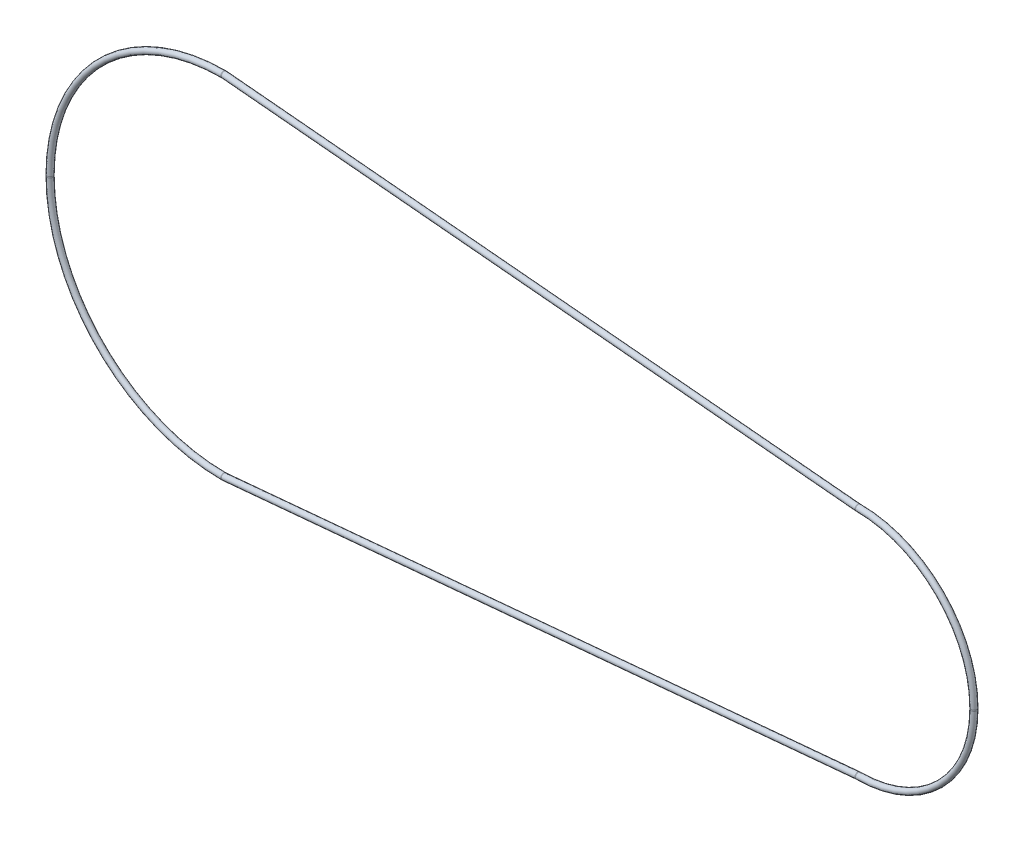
ISO-10303-21;
HEADER;
FILE_DESCRIPTION(('STEP AP214'),'2;1');
FILE_NAME('part.step','',(''),(''),'','','');
FILE_SCHEMA(('AUTOMOTIVE_DESIGN { 1 0 10303 214 1 1 1 1 }'));
ENDSEC;
DATA;
#1=APPLICATION_CONTEXT('core data for automotive mechanical design processes');
#2=APPLICATION_PROTOCOL_DEFINITION('international standard','automotive_design',2000,#1);
#3=PRODUCT_CONTEXT('',#1,'mechanical');
#4=PRODUCT('Part','Part','',(#3));
#5=PRODUCT_RELATED_PRODUCT_CATEGORY('part','',(#4));
#6=PRODUCT_DEFINITION_FORMATION('','',#4);
#7=PRODUCT_DEFINITION_CONTEXT('part definition',#1,'design');
#8=PRODUCT_DEFINITION('design','',#6,#7);
#9=PRODUCT_DEFINITION_SHAPE('','',#8);
#10=(LENGTH_UNIT() NAMED_UNIT(*) SI_UNIT(.MILLI.,.METRE.));
#11=(NAMED_UNIT(*) PLANE_ANGLE_UNIT() SI_UNIT($,.RADIAN.));
#12=(NAMED_UNIT(*) SI_UNIT($,.STERADIAN.) SOLID_ANGLE_UNIT());
#13=UNCERTAINTY_MEASURE_WITH_UNIT(LENGTH_MEASURE(1.E-05),#10,'distance_accuracy_value','');
#14=(GEOMETRIC_REPRESENTATION_CONTEXT(3) GLOBAL_UNCERTAINTY_ASSIGNED_CONTEXT((#13)) GLOBAL_UNIT_ASSIGNED_CONTEXT((#10,
#11,#12)) REPRESENTATION_CONTEXT('',''));
#15=CARTESIAN_POINT('',(0.,0.,0.));
#16=DIRECTION('',(0.,0.,1.));
#17=DIRECTION('',(1.,0.,0.));
#18=AXIS2_PLACEMENT_3D('',#15,#16,#17);
#19=CARTESIAN_POINT('',(-52.0949708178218,31.5005265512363,9.00000000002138));
#20=DIRECTION('',(1.,0.,0.));
#21=DIRECTION('',(0.,0.,-1.));
#22=AXIS2_PLACEMENT_3D('',#19,#20,#21);
#23=CYLINDRICAL_SURFACE('',#22,0.500000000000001);
#24=CARTESIAN_POINT('',(-52.0949708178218,31.5005265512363,9.00000000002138));
#25=DIRECTION('',(1.,0.,0.));
#26=DIRECTION('',(0.,1.,0.));
#27=AXIS2_PLACEMENT_3D('',#24,#25,#26);
#28=CIRCLE('',#27,0.500000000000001);
#29=CARTESIAN_POINT('',(-52.0949708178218,32.0005265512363,9.00000000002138));
#30=VERTEX_POINT('',#29);
#31=EDGE_CURVE('E44',#30,#30,#28,.T.);
#32=ORIENTED_EDGE('',*,*,#31,.T.);
#33=EDGE_LOOP('',(#32));
#34=FACE_BOUND('',#33,.T.);
#35=CARTESIAN_POINT('',(-51.972121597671,32.0005265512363,9.00000000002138));
#36=CARTESIAN_POINT('',(-51.9721216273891,32.0005266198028,8.99353181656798));
#37=CARTESIAN_POINT('',(-51.9721274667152,32.0004010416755,8.98706363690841));
#38=CARTESIAN_POINT('',(-51.9721507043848,31.999898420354,8.9741199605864));
#39=CARTESIAN_POINT('',(-51.9721681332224,31.9995207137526,8.96764448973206));
#40=CARTESIAN_POINT('',(-51.9722145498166,31.9985123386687,8.95469612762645));
#41=CARTESIAN_POINT('',(-51.9722435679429,31.9978810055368,8.94822328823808));
#42=CARTESIAN_POINT('',(-51.972313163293,31.9963643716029,8.93529020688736));
#43=CARTESIAN_POINT('',(-51.9723537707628,31.9954784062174,8.92883004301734));
#44=CARTESIAN_POINT('',(-51.9724465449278,31.9934518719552,8.91593244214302));
#45=CARTESIAN_POINT('',(-51.9724987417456,31.9923106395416,8.90949510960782));
#46=CARTESIAN_POINT('',(-51.9726146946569,31.9897733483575,8.89665339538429));
#47=CARTESIAN_POINT('',(-51.9726784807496,31.9883766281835,8.8902491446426));
#48=CARTESIAN_POINT('',(-51.9728176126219,31.9853285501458,8.87748389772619));
#49=CARTESIAN_POINT('',(-51.9728929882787,31.9836765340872,8.87112305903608));
#50=CARTESIAN_POINT('',(-51.9730552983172,31.9801184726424,8.85845500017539));
#51=CARTESIAN_POINT('',(-51.9731422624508,31.9782117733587,8.85214796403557));
#52=CARTESIAN_POINT('',(-51.9733277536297,31.9741453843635,8.8395979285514));
#53=CARTESIAN_POINT('',(-51.9734263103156,31.9719850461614,8.83335513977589));
#54=CARTESIAN_POINT('',(-51.9736349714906,31.9674128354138,8.82094401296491));
#55=CARTESIAN_POINT('',(-51.9737451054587,31.9650003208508,8.8147759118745));
#56=CARTESIAN_POINT('',(-51.9739707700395,31.9600615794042,8.80285272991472));
#57=CARTESIAN_POINT('',(-51.9740857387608,31.9575474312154,8.79709263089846));
#58=CARTESIAN_POINT('',(-51.9743267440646,31.9522795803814,8.78561851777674));
#59=CARTESIAN_POINT('',(-51.9744528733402,31.9495238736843,8.77990542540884));
#60=CARTESIAN_POINT('',(-51.9747161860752,31.9437709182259,8.76853641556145));
#61=CARTESIAN_POINT('',(-51.9748534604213,31.9407716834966,8.76288150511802));
#62=CARTESIAN_POINT('',(-51.9751390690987,31.934530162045,8.75164023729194));
#63=CARTESIAN_POINT('',(-51.9752874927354,31.9312859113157,8.74605497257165));
#64=CARTESIAN_POINT('',(-51.9755954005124,31.9245533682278,8.73496468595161));
#65=CARTESIAN_POINT('',(-51.9757549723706,31.9210631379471,8.72946084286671));
#66=CARTESIAN_POINT('',(-51.9760851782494,31.9138381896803,8.71854537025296));
#67=CARTESIAN_POINT('',(-51.976255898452,31.9101015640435,8.71313500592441));
#68=CARTESIAN_POINT('',(-51.9766084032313,31.9023839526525,8.70241872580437));
#69=CARTESIAN_POINT('',(-51.9767902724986,31.8984010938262,8.69711416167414));
#70=CARTESIAN_POINT('',(-51.9771650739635,31.8901917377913,8.68662195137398));
#71=CARTESIAN_POINT('',(-51.9773580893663,31.885963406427,8.68143574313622));
#72=CARTESIAN_POINT('',(-51.9777551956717,31.8772644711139,8.67119294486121));
#73=CARTESIAN_POINT('',(-51.9779593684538,31.8727920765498,8.66613787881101));
#74=CARTESIAN_POINT('',(-51.9783787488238,31.8636069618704,8.65617018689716));
#75=CARTESIAN_POINT('',(-51.9785940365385,31.8588924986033,8.65125916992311));
#76=CARTESIAN_POINT('',(-51.979006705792,31.8498629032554,8.64222956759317));
#77=CARTESIAN_POINT('',(-51.9792030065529,31.8455705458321,8.6380881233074));
#78=CARTESIAN_POINT('',(-51.9796067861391,31.8367458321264,8.62987337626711));
#79=CARTESIAN_POINT('',(-51.9798144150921,31.832210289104,8.62580350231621));
#80=CARTESIAN_POINT('',(-51.9802408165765,31.8228957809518,8.61774773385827));
#81=CARTESIAN_POINT('',(-51.9804597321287,31.8181136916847,8.61376545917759));
#82=CARTESIAN_POINT('',(-51.9809087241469,31.8083034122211,8.60590135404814));
#83=CARTESIAN_POINT('',(-51.9811389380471,31.8032721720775,8.60202333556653));
#84=CARTESIAN_POINT('',(-51.9816105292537,31.79296179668,8.59438488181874));
#85=CARTESIAN_POINT('',(-51.981852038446,31.7876796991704,8.59062845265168));
#86=CARTESIAN_POINT('',(-51.9823462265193,31.776866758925,8.58325094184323));
#87=CARTESIAN_POINT('',(-51.9825990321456,31.771333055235,8.5796340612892));
#88=CARTESIAN_POINT('',(-51.9831158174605,31.7600170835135,8.57255400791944));
#89=CARTESIAN_POINT('',(-51.9833799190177,31.7542320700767,8.56909523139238));
#90=CARTESIAN_POINT('',(-51.9839193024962,31.74241475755,8.56235029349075));
#91=CARTESIAN_POINT('',(-51.9841947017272,31.7363798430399,8.55906872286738));
#92=CARTESIAN_POINT('',(-51.9847566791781,31.7240652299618,8.55269761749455));
#93=CARTESIAN_POINT('',(-51.9850433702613,31.7177830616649,8.54961286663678));
#94=CARTESIAN_POINT('',(-51.9856279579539,31.7049775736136,8.54365521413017));
#95=CARTESIAN_POINT('',(-51.985925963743,31.6984519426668,8.5407872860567));
#96=CARTESIAN_POINT('',(-51.98647903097,31.6863482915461,8.53577378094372));
#97=CARTESIAN_POINT('',(-51.9867332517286,31.6807875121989,8.53358635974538));
#98=CARTESIAN_POINT('',(-51.9872573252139,31.6693238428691,8.52931256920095));
#99=CARTESIAN_POINT('',(-51.9875273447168,31.6634172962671,8.52723601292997));
#100=CARTESIAN_POINT('',(-51.9880830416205,31.6512597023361,8.52321665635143));
#101=CARTESIAN_POINT('',(-51.9883688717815,31.6450052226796,8.52128426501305));
#102=CARTESIAN_POINT('',(-51.9889562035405,31.6321509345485,8.51758765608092));
#103=CARTESIAN_POINT('',(-51.989257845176,31.6255479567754,8.51583444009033));
#104=CARTESIAN_POINT('',(-51.9897173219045,31.6154903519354,8.51338338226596));
#105=CARTESIAN_POINT('',(-51.9898740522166,31.612059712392,8.51258563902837));
#106=CARTESIAN_POINT('',(-51.9901914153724,31.6051126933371,8.51104739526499));
#107=CARTESIAN_POINT('',(-51.9903520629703,31.6015959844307,8.51030838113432));
#108=CARTESIAN_POINT('',(-51.9907283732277,31.5933633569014,8.5086708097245));
#109=CARTESIAN_POINT('',(-51.9909443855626,31.5886415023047,8.5078020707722));
#110=CARTESIAN_POINT('',(-51.9914168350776,31.5783147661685,8.50605549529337));
#111=CARTESIAN_POINT('',(-51.9916734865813,31.5727053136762,8.50520468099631));
#112=CARTESIAN_POINT('',(-51.9922272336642,31.5605962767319,8.50357834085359));
#113=CARTESIAN_POINT('',(-51.9925244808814,31.5540924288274,8.50283449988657));
#114=CARTESIAN_POINT('',(-51.993159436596,31.5401922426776,8.50152066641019));
#115=CARTESIAN_POINT('',(-51.9934972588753,31.5327924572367,8.50098704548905));
#116=CARTESIAN_POINT('',(-51.9942135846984,31.5171053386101,8.50020618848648));
#117=CARTESIAN_POINT('',(-51.994592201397,31.5088159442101,8.50000000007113));
#118=CARTESIAN_POINT('',(-51.9953491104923,31.4922442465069,8.49999999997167));
#119=CARTESIAN_POINT('',(-51.9957274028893,31.4839619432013,8.50020583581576));
#120=CARTESIAN_POINT('',(-51.9964432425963,31.4682854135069,8.50098549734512));
#121=CARTESIAN_POINT('',(-51.9967809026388,31.4608891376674,8.50151846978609));
#122=CARTESIAN_POINT('',(-51.997415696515,31.4469923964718,8.50283108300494));
#123=CARTESIAN_POINT('',(-51.9977129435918,31.4404885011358,8.50357450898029));
#124=CARTESIAN_POINT('',(-51.998266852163,31.4283758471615,8.50520054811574));
#125=CARTESIAN_POINT('',(-51.998523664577,31.4227628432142,8.50605159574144));
#126=CARTESIAN_POINT('',(-51.9989966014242,31.4124255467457,8.50779950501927));
#127=CARTESIAN_POINT('',(-51.9992129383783,31.4076966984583,8.50866942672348));
#128=CARTESIAN_POINT('',(-51.9995893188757,31.3994627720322,8.51030725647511));
#129=CARTESIAN_POINT('',(-51.9997497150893,31.3959516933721,8.51104502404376));
#130=CARTESIAN_POINT('',(-52.0000666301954,31.3890146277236,8.51258081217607));
#131=CARTESIAN_POINT('',(-52.0002231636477,31.3855883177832,8.51337737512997));
#132=CARTESIAN_POINT('',(-52.0006822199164,31.3755398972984,8.51582554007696));
#133=CARTESIAN_POINT('',(-52.0009836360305,31.3689417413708,8.51757693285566));
#134=CARTESIAN_POINT('',(-52.0015707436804,31.3560920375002,8.52127094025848));
#135=CARTESIAN_POINT('',(-52.0018565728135,31.3498373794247,8.52320275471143));
#136=CARTESIAN_POINT('',(-52.0024124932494,31.3376745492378,8.52722259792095));
#137=CARTESIAN_POINT('',(-52.0026827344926,31.3317630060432,8.52930040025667));
#138=CARTESIAN_POINT('',(-52.0032074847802,31.3202846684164,8.53357885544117));
#139=CARTESIAN_POINT('',(-52.0034621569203,31.3147142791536,8.53576985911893));
#140=CARTESIAN_POINT('',(-52.0040154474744,31.302606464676,8.54078508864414));
#141=CARTESIAN_POINT('',(-52.00431323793,31.296086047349,8.54365059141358));
#142=CARTESIAN_POINT('',(-52.0048974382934,31.2832896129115,8.54960349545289));
#143=CARTESIAN_POINT('',(-52.0051839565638,31.2770113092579,8.55268597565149));
#144=CARTESIAN_POINT('',(-52.0057456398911,31.2647031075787,8.55905280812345));
#145=CARTESIAN_POINT('',(-52.0060209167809,31.2586707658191,8.56233242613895));
#146=CARTESIAN_POINT('',(-52.0065601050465,31.2468573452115,8.56907388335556));
#147=CARTESIAN_POINT('',(-52.006824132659,31.2410736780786,8.57253117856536));
#148=CARTESIAN_POINT('',(-52.0073408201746,31.2297592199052,8.57960883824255));
#149=CARTESIAN_POINT('',(-52.007593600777,31.2242257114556,8.58322485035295));
#150=CARTESIAN_POINT('',(-52.0080877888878,31.2134120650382,8.59060132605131));
#151=CARTESIAN_POINT('',(-52.0083293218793,31.20812909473,8.5943576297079));
#152=CARTESIAN_POINT('',(-52.0088010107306,31.1978159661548,8.60199665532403));
#153=CARTESIAN_POINT('',(-52.0090312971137,31.1927828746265,8.60587540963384));
#154=CARTESIAN_POINT('',(-52.0094804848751,31.1829679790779,8.61374191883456));
#155=CARTESIAN_POINT('',(-52.0096995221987,31.1781831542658,8.61772589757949));
#156=CARTESIAN_POINT('',(-52.0101262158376,31.1688623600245,8.6257861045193));
#157=CARTESIAN_POINT('',(-52.0103340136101,31.1643232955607,8.62985874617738));
#158=CARTESIAN_POINT('',(-52.0107381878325,31.1554908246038,8.63808014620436));
#159=CARTESIAN_POINT('',(-52.0109347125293,31.1511942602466,8.64222550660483));
#160=CARTESIAN_POINT('',(-52.0113474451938,31.1421647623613,8.65125501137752));
#161=CARTESIAN_POINT('',(-52.0115625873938,31.1374542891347,8.65616169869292));
#162=CARTESIAN_POINT('',(-52.0119817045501,31.1282759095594,8.66612137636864));
#163=CARTESIAN_POINT('',(-52.0121857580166,31.1238063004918,8.67117279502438));
#164=CARTESIAN_POINT('',(-52.0125826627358,31.1151117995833,8.68140907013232));
#165=CARTESIAN_POINT('',(-52.0127755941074,31.1108851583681,8.68659243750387));
#166=CARTESIAN_POINT('',(-52.013150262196,31.1026781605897,8.69707985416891));
#167=CARTESIAN_POINT('',(-52.0133320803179,31.0986960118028,8.7023824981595));
#168=CARTESIAN_POINT('',(-52.0136845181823,31.0909789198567,8.71309593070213));
#169=CARTESIAN_POINT('',(-52.013855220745,31.0872421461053,8.71850539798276));
#170=CARTESIAN_POINT('',(-52.0141854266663,31.0800161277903,8.72942016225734));
#171=CARTESIAN_POINT('',(-52.0143450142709,31.0765250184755,8.7349242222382));
#172=CARTESIAN_POINT('',(-52.014652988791,31.0697900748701,8.7460161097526));
#173=CARTESIAN_POINT('',(-52.0148014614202,31.0665443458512,8.75160278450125));
#174=CARTESIAN_POINT('',(-52.0150872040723,31.0602993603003,8.76284810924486));
#175=CARTESIAN_POINT('',(-52.0152245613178,31.0572981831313,8.76850569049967));
#176=CARTESIAN_POINT('',(-52.0154880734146,31.0515409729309,8.77988133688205));
#177=CARTESIAN_POINT('',(-52.0156143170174,31.0487829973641,8.78559841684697));
#178=CARTESIAN_POINT('',(-52.0158555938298,31.0435103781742,8.79708184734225));
#179=CARTESIAN_POINT('',(-52.0159707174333,31.0409937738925,8.80284729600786));
#180=CARTESIAN_POINT('',(-52.0161965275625,31.0360538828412,8.81477325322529));
#181=CARTESIAN_POINT('',(-52.0163066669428,31.0336423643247,8.82093865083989));
#182=CARTESIAN_POINT('',(-52.016515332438,31.0290717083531,8.83334489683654));
#183=CARTESIAN_POINT('',(-52.0166138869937,31.0269119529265,8.83958551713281));
#184=CARTESIAN_POINT('',(-52.016799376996,31.0228463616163,8.85213177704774));
#185=CARTESIAN_POINT('',(-52.0168863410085,31.0209399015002,8.85843721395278));
#186=CARTESIAN_POINT('',(-52.0170486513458,31.0173820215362,8.87110266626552));
#187=CARTESIAN_POINT('',(-52.0171240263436,31.0157299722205,8.87746250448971));
#188=CARTESIAN_POINT('',(-52.0172631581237,31.0126816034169,8.89022636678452));
#189=CARTESIAN_POINT('',(-52.0173269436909,31.0112846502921,8.89663023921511));
#190=CARTESIAN_POINT('',(-52.0174428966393,31.0087467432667,8.90947183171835));
#191=CARTESIAN_POINT('',(-52.0174950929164,31.0076051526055,8.91590942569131));
#192=CARTESIAN_POINT('',(-52.0175878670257,31.0055778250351,8.92880819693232));
#193=CARTESIAN_POINT('',(-52.0176284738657,31.0046914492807,8.93526927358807));
#194=CARTESIAN_POINT('',(-52.0176980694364,31.0031739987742,8.94820483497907));
#195=CARTESIAN_POINT('',(-52.0177270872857,31.0025422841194,8.95467924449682));
#196=CARTESIAN_POINT('',(-52.0177735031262,31.0015332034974,8.96763140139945));
#197=CARTESIAN_POINT('',(-52.0177909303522,31.0011551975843,8.97410909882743));
#198=CARTESIAN_POINT('',(-52.0178141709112,31.0006521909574,8.98705788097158));
#199=CARTESIAN_POINT('',(-52.0178200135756,31.000526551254,8.99352894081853));
#200=CARTESIAN_POINT('',(-52.0178200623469,31.0005265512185,9.00646514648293));
#201=CARTESIAN_POINT('',(-52.0178142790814,31.0006519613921,9.01293029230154));
#202=CARTESIAN_POINT('',(-52.0177911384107,31.0011541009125,9.02586858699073));
#203=CARTESIAN_POINT('',(-52.0177737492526,31.001531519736,9.03234170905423));
#204=CARTESIAN_POINT('',(-52.0177274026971,31.0025391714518,9.04528606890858));
#205=CARTESIAN_POINT('',(-52.0176984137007,31.0031700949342,9.05175725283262));
#206=CARTESIAN_POINT('',(-52.017628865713,31.0046858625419,9.06468771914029));
#207=CARTESIAN_POINT('',(-52.0175882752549,31.0055713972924,9.07114692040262));
#208=CARTESIAN_POINT('',(-52.0174955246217,31.0075970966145,9.08404328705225));
#209=CARTESIAN_POINT('',(-52.0174433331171,31.0087379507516,9.09048034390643));
#210=CARTESIAN_POINT('',(-52.017327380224,31.0112745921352,9.10332218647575));
#211=CARTESIAN_POINT('',(-52.0172635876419,31.0126710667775,9.10972683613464));
#212=CARTESIAN_POINT('',(-52.0171244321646,31.0157188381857,9.12249354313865));
#213=CARTESIAN_POINT('',(-52.0170490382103,31.0173708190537,9.12885543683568));
#214=CARTESIAN_POINT('',(-52.0168866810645,31.0209290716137,9.14152624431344));
#215=CARTESIAN_POINT('',(-52.016799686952,31.0228360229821,9.1478349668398));
#216=CARTESIAN_POINT('',(-52.0166141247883,31.0269032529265,9.16038898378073));
#217=CARTESIAN_POINT('',(-52.0165155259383,31.0290642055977,9.16663405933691));
#218=CARTESIAN_POINT('',(-52.0163067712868,31.0336380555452,9.17905033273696));
#219=CARTESIAN_POINT('',(-52.0161965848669,31.0360516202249,9.1852212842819));
#220=CARTESIAN_POINT('',(-52.0159708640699,31.0409915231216,9.19714727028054));
#221=CARTESIAN_POINT('',(-52.0158558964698,31.0435056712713,9.20290736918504));
#222=CARTESIAN_POINT('',(-52.0156148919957,31.0487735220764,9.21438148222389));
#223=CARTESIAN_POINT('',(-52.0154887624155,31.051529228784,9.22009457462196));
#224=CARTESIAN_POINT('',(-52.0152254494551,31.0572821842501,9.23146358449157));
#225=CARTESIAN_POINT('',(-52.0150881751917,31.0602814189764,9.23711849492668));
#226=CARTESIAN_POINT('',(-52.0148025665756,31.0665229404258,9.24835976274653));
#227=CARTESIAN_POINT('',(-52.0146541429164,31.0697671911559,9.25394502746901));
#228=CARTESIAN_POINT('',(-52.0143462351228,31.0764997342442,9.26503531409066));
#229=CARTESIAN_POINT('',(-52.0141866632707,31.0799899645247,9.27053915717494));
#230=CARTESIAN_POINT('',(-52.0138564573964,31.0872149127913,9.28145462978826));
#231=CARTESIAN_POINT('',(-52.0136857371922,31.0909515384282,9.28686499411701));
#232=CARTESIAN_POINT('',(-52.0133332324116,31.0986691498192,9.29758127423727));
#233=CARTESIAN_POINT('',(-52.0131513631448,31.1026520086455,9.30288583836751));
#234=CARTESIAN_POINT('',(-52.0127765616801,31.1108613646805,9.31337804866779));
#235=CARTESIAN_POINT('',(-52.0125835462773,31.1150896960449,9.31856425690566));
#236=CARTESIAN_POINT('',(-52.0121864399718,31.1237886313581,9.32880705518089));
#237=CARTESIAN_POINT('',(-52.0119822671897,31.1282610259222,9.33386212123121));
#238=CARTESIAN_POINT('',(-52.0115628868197,31.1374461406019,9.34382981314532));
#239=CARTESIAN_POINT('',(-52.011347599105,31.1421606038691,9.34874083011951));
#240=CARTESIAN_POINT('',(-52.0109349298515,31.1511901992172,9.3577704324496));
#241=CARTESIAN_POINT('',(-52.0107386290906,31.1554825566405,9.36191187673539));
#242=CARTESIAN_POINT('',(-52.0103348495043,31.1643072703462,9.37012662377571));
#243=CARTESIAN_POINT('',(-52.0101272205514,31.1688428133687,9.37419649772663));
#244=CARTESIAN_POINT('',(-52.009700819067,31.1781573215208,9.38225226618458));
#245=CARTESIAN_POINT('',(-52.0094819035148,31.182939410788,9.38623454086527));
#246=CARTESIAN_POINT('',(-52.0090329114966,31.1927496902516,9.39409864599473));
#247=CARTESIAN_POINT('',(-52.0088026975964,31.1977809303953,9.39797666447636));
#248=CARTESIAN_POINT('',(-52.0083311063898,31.2080913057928,9.40561511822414));
#249=CARTESIAN_POINT('',(-52.0080895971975,31.2133734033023,9.4093715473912));
#250=CARTESIAN_POINT('',(-52.0075954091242,31.2241863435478,9.41674905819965));
#251=CARTESIAN_POINT('',(-52.0073426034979,31.2297200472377,9.42036593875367));
#252=CARTESIAN_POINT('',(-52.006825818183,31.2410360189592,9.42744599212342));
#253=CARTESIAN_POINT('',(-52.0065617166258,31.246821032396,9.43090476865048));
#254=CARTESIAN_POINT('',(-52.0060223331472,31.2586383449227,9.43764970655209));
#255=CARTESIAN_POINT('',(-52.0057469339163,31.2646732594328,9.44093127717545));
#256=CARTESIAN_POINT('',(-52.0051849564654,31.2769878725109,9.44730238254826));
#257=CARTESIAN_POINT('',(-52.0048982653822,31.2832700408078,9.45038713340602));
#258=CARTESIAN_POINT('',(-52.0043136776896,31.296075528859,9.45634478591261));
#259=CARTESIAN_POINT('',(-52.0040156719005,31.3026011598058,9.45921271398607));
#260=CARTESIAN_POINT('',(-52.0034626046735,31.3147048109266,9.46422621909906));
#261=CARTESIAN_POINT('',(-52.0032083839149,31.3202655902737,9.46641364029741));
#262=CARTESIAN_POINT('',(-52.0026843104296,31.3317292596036,9.47068743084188));
#263=CARTESIAN_POINT('',(-52.0024142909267,31.3376358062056,9.47276398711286));
#264=CARTESIAN_POINT('',(-52.0018585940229,31.3497934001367,9.4767833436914));
#265=CARTESIAN_POINT('',(-52.001572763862,31.3560478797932,9.47871573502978));
#266=CARTESIAN_POINT('',(-52.000985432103,31.3689021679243,9.4824123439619));
#267=CARTESIAN_POINT('',(-52.0006837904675,31.3755051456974,9.48416555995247));
#268=CARTESIAN_POINT('',(-52.000224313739,31.3855627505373,9.48661661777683));
#269=CARTESIAN_POINT('',(-52.0000675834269,31.3889933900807,9.48741436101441));
#270=CARTESIAN_POINT('',(-51.9997502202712,31.3959404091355,9.48895260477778));
#271=CARTESIAN_POINT('',(-51.9995895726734,31.3994571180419,9.48969161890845));
#272=CARTESIAN_POINT('',(-51.9992132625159,31.4076897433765,9.49132918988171));
#273=CARTESIAN_POINT('',(-51.9989972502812,31.4124115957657,9.49219792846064));
#274=CARTESIAN_POINT('',(-51.9985248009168,31.4227383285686,9.49394450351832));
#275=CARTESIAN_POINT('',(-51.9982681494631,31.42834777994,9.49479531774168));
#276=CARTESIAN_POINT('',(-51.9977144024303,31.4404568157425,9.49642165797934));
#277=CARTESIAN_POINT('',(-51.9974171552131,31.446960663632,9.49716549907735));
#278=CARTESIAN_POINT('',(-51.9967821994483,31.4608608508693,9.49847933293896));
#279=CARTESIAN_POINT('',(-51.9964443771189,31.468260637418,9.49901295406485));
#280=CARTESIAN_POINT('',(-51.9957280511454,31.4839477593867,9.49979381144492));
#281=CARTESIAN_POINT('',(-51.9953494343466,31.4922371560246,9.49999999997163));
#282=CARTESIAN_POINT('',(-51.994592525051,31.5088088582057,9.50000000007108));
#283=CARTESIAN_POINT('',(-51.9942142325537,31.5170911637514,9.49979416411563));
#284=CARTESIAN_POINT('',(-51.9934983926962,31.532767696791,9.49901450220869));
#285=CARTESIAN_POINT('',(-51.9931607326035,31.5401639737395,9.4984815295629));
#286=CARTESIAN_POINT('',(-51.992525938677,31.5540607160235,9.49716891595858));
#287=CARTESIAN_POINT('',(-51.9922286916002,31.5605646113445,9.49642548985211));
#288=CARTESIAN_POINT('',(-51.9916747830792,31.5726772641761,9.4947994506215));
#289=CARTESIAN_POINT('',(-51.9914179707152,31.5782902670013,9.49394840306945));
#290=CARTESIAN_POINT('',(-51.9909450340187,31.5886275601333,9.49220049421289));
#291=CARTESIAN_POINT('',(-51.990728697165,31.593356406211,9.4913305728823));
#292=CARTESIAN_POINT('',(-51.9903523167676,31.6015903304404,9.48969274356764));
#293=CARTESIAN_POINT('',(-51.9901919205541,31.6051014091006,9.48895497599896));
#294=CARTESIAN_POINT('',(-51.9898750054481,31.6120384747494,9.4874191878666));
#295=CARTESIAN_POINT('',(-51.9897184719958,31.6154647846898,9.48662262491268));
#296=CARTESIAN_POINT('',(-51.989259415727,31.6255132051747,9.48417445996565));
#297=CARTESIAN_POINT('',(-51.9889579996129,31.6321113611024,9.48242306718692));
#298=CARTESIAN_POINT('',(-51.9883708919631,31.6449610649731,9.47872905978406));
#299=CARTESIAN_POINT('',(-51.98808506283,31.6512157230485,9.4767972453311));
#300=CARTESIAN_POINT('',(-51.9875291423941,31.6633785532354,9.47277740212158));
#301=CARTESIAN_POINT('',(-51.9872589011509,31.6692900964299,9.47069959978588));
#302=CARTESIAN_POINT('',(-51.9867341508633,31.6807684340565,9.46642114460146));
#303=CARTESIAN_POINT('',(-51.9864794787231,31.6863388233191,9.46423014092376));
#304=CARTESIAN_POINT('',(-51.9859261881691,31.698446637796,9.45921491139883));
#305=CARTESIAN_POINT('',(-51.9856283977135,31.7049670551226,9.45634940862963));
#306=CARTESIAN_POINT('',(-51.9850441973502,31.7177634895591,9.45039650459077));
#307=CARTESIAN_POINT('',(-51.9847576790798,31.7240417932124,9.44731402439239));
#308=CARTESIAN_POINT('',(-51.9841959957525,31.7363499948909,9.44094719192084));
#309=CARTESIAN_POINT('',(-51.9839207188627,31.7423823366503,9.43766757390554));
#310=CARTESIAN_POINT('',(-51.9833815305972,31.7541957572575,9.43092611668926));
#311=CARTESIAN_POINT('',(-51.9831175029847,31.7599794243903,9.4274688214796));
#312=CARTESIAN_POINT('',(-51.9826008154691,31.7712938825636,9.42039116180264));
#313=CARTESIAN_POINT('',(-51.9823480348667,31.7768273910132,9.41677514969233));
#314=CARTESIAN_POINT('',(-51.9818538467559,31.7876410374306,9.40939867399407));
#315=CARTESIAN_POINT('',(-51.9816123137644,31.7929240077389,9.40564237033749));
#316=CARTESIAN_POINT('',(-51.9811406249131,31.8032371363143,9.3980033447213));
#317=CARTESIAN_POINT('',(-51.9809103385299,31.8082702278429,9.39412459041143));
#318=CARTESIAN_POINT('',(-51.9804611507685,31.8180851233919,9.38625808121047));
#319=CARTESIAN_POINT('',(-51.9802421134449,31.8228699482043,9.38227410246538));
#320=CARTESIAN_POINT('',(-51.979815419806,31.8321907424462,9.37421389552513));
#321=CARTESIAN_POINT('',(-51.9796076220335,31.8367298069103,9.37014125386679));
#322=CARTESIAN_POINT('',(-51.979203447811,31.845562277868,9.36191985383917));
#323=CARTESIAN_POINT('',(-51.9790069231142,31.8498588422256,9.35777449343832));
#324=CARTESIAN_POINT('',(-51.9785941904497,31.8588883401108,9.34874498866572));
#325=CARTESIAN_POINT('',(-51.9783790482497,31.863598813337,9.34383830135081));
#326=CARTESIAN_POINT('',(-51.9779599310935,31.8727771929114,9.33387862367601));
#327=CARTESIAN_POINT('',(-51.977755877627,31.8772468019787,9.3288272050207));
#328=CARTESIAN_POINT('',(-51.9773589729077,31.8859413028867,9.3185909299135));
#329=CARTESIAN_POINT('',(-51.977166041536,31.8901679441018,9.31340756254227));
#330=CARTESIAN_POINT('',(-51.9767913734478,31.8983749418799,9.30292014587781));
#331=CARTESIAN_POINT('',(-51.9766095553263,31.9023570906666,9.29761750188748));
#332=CARTESIAN_POINT('',(-51.9762571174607,31.9100741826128,9.28690406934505));
#333=CARTESIAN_POINT('',(-51.9760864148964,31.9138109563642,9.28149460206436));
#334=CARTESIAN_POINT('',(-51.9757562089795,31.9210369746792,9.27057983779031));
#335=CARTESIAN_POINT('',(-51.9755966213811,31.9245280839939,9.26507577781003));
#336=CARTESIAN_POINT('',(-51.9752886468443,31.9312630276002,9.2539838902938));
#337=CARTESIAN_POINT('',(-51.9751401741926,31.9345087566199,9.24839721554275));
#338=CARTESIAN_POINT('',(-51.9748544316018,31.9407537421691,9.23715189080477));
#339=CARTESIAN_POINT('',(-51.9747170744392,31.9437549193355,9.2314943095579));
#340=CARTESIAN_POINT('',(-51.9744535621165,31.9495121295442,9.2201186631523));
#341=CARTESIAN_POINT('',(-51.9743273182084,31.9522701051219,9.21440158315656));
#342=CARTESIAN_POINT('',(-51.9740860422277,31.9575427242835,9.20291815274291));
#343=CARTESIAN_POINT('',(-51.9739709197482,31.9600593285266,9.19715270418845));
#344=CARTESIAN_POINT('',(-51.9737450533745,31.965000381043,9.18522394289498));
#345=CARTESIAN_POINT('',(-51.9736348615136,31.9674129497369,9.17905569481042));
#346=CARTESIAN_POINT('',(-51.9734261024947,31.9719852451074,9.16664430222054));
#347=CARTESIAN_POINT('',(-51.9733275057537,31.9741456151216,9.16040139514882));
#348=CARTESIAN_POINT('',(-51.9731419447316,31.9782120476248,9.14785115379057));
#349=CARTESIAN_POINT('',(-51.973054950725,31.9801187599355,9.14154403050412));
#350=CARTESIAN_POINT('',(-51.9728925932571,31.9836768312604,9.12887582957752));
#351=CARTESIAN_POINT('',(-51.9728171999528,31.9853288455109,9.12251493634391));
#352=CARTESIAN_POINT('',(-51.9726780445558,31.988376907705,9.10974961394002));
#353=CARTESIAN_POINT('',(-51.9726142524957,31.9897736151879,9.10334534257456));
#354=CARTESIAN_POINT('',(-51.9724982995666,31.9923108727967,9.09050362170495));
#355=CARTESIAN_POINT('',(-51.9724461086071,31.9934520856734,9.08406630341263));
#356=CARTESIAN_POINT('',(-51.9723533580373,31.9954785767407,9.07116876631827));
#357=CARTESIAN_POINT('',(-51.9723127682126,31.9963645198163,9.06470865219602));
#358=CARTESIAN_POINT('',(-51.9722432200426,31.9978811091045,9.05177570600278));
#359=CARTESIAN_POINT('',(-51.9722142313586,31.9985124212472,9.04530295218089));
#360=CARTESIAN_POINT('',(-51.9721678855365,31.9995207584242,9.03235479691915));
#361=CARTESIAN_POINT('',(-51.9721504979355,31.9998984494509,9.02587944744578));
#362=CARTESIAN_POINT('',(-51.972127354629,32.0004010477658,9.01293604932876));
#363=CARTESIAN_POINT('',(-51.9721215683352,32.0005266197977,9.00646802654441));
#364=CARTESIAN_POINT('',(-51.972121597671,32.0005265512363,9.00000000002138));
#365=B_SPLINE_CURVE_WITH_KNOTS('',3,(#35,#36,#37,#38,#39,#40,#41,#42,#43,#44,#45,#46,#47,#48,
#49,#50,#51,#52,#53,#54,#55,#56,#57,#58,#59,#60,#61,#62,#63,#64,#65,#66,#67,#68,#69,#70,#71,#72,
#73,#74,#75,#76,#77,#78,#79,#80,#81,#82,#83,#84,#85,#86,#87,#88,#89,#90,#91,#92,#93,#94,#95,#96,
#97,#98,#99,#100,#101,#102,#103,#104,#105,#106,#107,#108,#109,#110,#111,#112,#113,#114,#115,
#116,#117,#118,#119,#120,#121,#122,#123,#124,#125,#126,#127,#128,#129,#130,#131,#132,#133,#134,
#135,#136,#137,#138,#139,#140,#141,#142,#143,#144,#145,#146,#147,#148,#149,#150,#151,#152,#153,
#154,#155,#156,#157,#158,#159,#160,#161,#162,#163,#164,#165,#166,#167,#168,#169,#170,#171,#172,
#173,#174,#175,#176,#177,#178,#179,#180,#181,#182,#183,#184,#185,#186,#187,#188,#189,#190,#191,
#192,#193,#194,#195,#196,#197,#198,#199,#200,#201,#202,#203,#204,#205,#206,#207,#208,#209,#210,
#211,#212,#213,#214,#215,#216,#217,#218,#219,#220,#221,#222,#223,#224,#225,#226,#227,#228,#229,
#230,#231,#232,#233,#234,#235,#236,#237,#238,#239,#240,#241,#242,#243,#244,#245,#246,#247,#248,
#249,#250,#251,#252,#253,#254,#255,#256,#257,#258,#259,#260,#261,#262,#263,#264,#265,#266,#267,
#268,#269,#270,#271,#272,#273,#274,#275,#276,#277,#278,#279,#280,#281,#282,#283,#284,#285,#286,
#287,#288,#289,#290,#291,#292,#293,#294,#295,#296,#297,#298,#299,#300,#301,#302,#303,#304,#305,
#306,#307,#308,#309,#310,#311,#312,#313,#314,#315,#316,#317,#318,#319,#320,#321,#322,#323,#324,
#325,#326,#327,#328,#329,#330,#331,#332,#333,#334,#335,#336,#337,#338,#339,#340,#341,#342,#343,
#344,#345,#346,#347,#348,#349,#350,#351,#352,#353,#354,#355,#356,#357,#358,#359,#360,#361,#362,
#363,#364),.UNSPECIFIED.,.F.,.F.,(4,2,2,2,2,2,2,2,2,2,2,2,2,2,2,2,2,2,2,2,2,2,2,2,2,2,2,2,2,2,2,
2,2,2,2,2,2,2,2,2,2,2,2,2,2,2,2,2,2,2,2,2,2,2,2,2,2,2,2,2,2,2,2,2,2,2,2,2,2,2,2,2,2,2,2,2,2,2,2,
2,2,2,2,2,2,2,2,2,2,2,2,2,2,2,2,2,2,2,2,2,2,2,2,2,2,2,2,2,2,2,2,2,2,2,2,2,2,2,2,2,2,2,2,2,2,2,2,
2,2,2,2,2,2,2,2,2,2,2,2,2,2,2,2,2,2,2,2,2,2,2,2,2,2,2,2,2,2,2,2,2,2,2,2,2,4),(0.,
0.0194033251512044,0.0388579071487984,0.0583638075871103,0.0779210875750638,0.0975298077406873,
0.117190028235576,0.136901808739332,0.156665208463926,0.176480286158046,0.196347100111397,
0.215200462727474,0.234228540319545,0.253431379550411,0.272809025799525,0.292361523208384,
0.312088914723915,0.331991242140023,0.352068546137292,0.372320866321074,0.392748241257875,
0.410647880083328,0.428935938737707,0.447612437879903,0.466677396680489,0.486130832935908,
0.505972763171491,0.526203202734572,0.546822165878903,0.567829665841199,0.589225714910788,
0.607164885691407,0.625960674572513,0.645613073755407,0.666122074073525,0.676698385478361,
0.687488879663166,0.701904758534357,0.718939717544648,0.738593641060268,0.760866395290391,
0.785757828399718,0.810627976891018,0.832890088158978,0.852544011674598,0.869589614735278,
0.884026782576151,0.894799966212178,0.905362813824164,0.925856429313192,0.945508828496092,
0.964320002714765,0.982289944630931,1.0036687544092,1.02466284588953,1.04527223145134,
1.06549692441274,1.0853369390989,1.10479229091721,1.12386299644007,1.14254907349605,
1.16085054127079,1.17876742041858,1.19917714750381,1.21941574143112,1.23948324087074,
1.25937968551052,1.27910511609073,1.29865957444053,1.31804310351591,1.33725574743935,
1.3562975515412,1.37516856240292,1.39502674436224,1.41483510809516,1.43459371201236,
1.45430261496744,1.47396187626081,1.49357155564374,1.51313171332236,1.5326424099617,
1.55210370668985,1.57151566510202,1.59090988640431,1.6103573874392,1.62985822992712,
1.64941247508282,1.66902018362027,1.68868141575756,1.70839623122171,1.72816468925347,
1.74798684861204,1.76786276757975,1.78671613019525,1.80574420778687,1.82494704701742,
1.84432469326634,1.86387719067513,1.88360458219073,1.90350690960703,1.92358421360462,
1.94383653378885,1.96426390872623,1.98216354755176,2.0004516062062,2.01912810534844,
2.03819306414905,2.05764650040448,2.07748843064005,2.09771887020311,2.11833783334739,
2.13934533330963,2.16074138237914,2.17868055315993,2.19747634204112,2.21712874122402,
2.23763774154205,2.24821405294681,2.25900454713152,2.27342041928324,2.29045537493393,
2.31010929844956,2.33238205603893,2.35727349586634,2.38214365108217,2.4044057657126,
2.42405968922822,2.44110528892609,2.45554245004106,2.46631563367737,2.47687848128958,
2.49737209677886,2.51702449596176,2.53583567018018,2.55380561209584,2.57518442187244,
2.59617851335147,2.61678789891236,2.6370125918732,2.65685260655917,2.67630795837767,
2.69537866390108,2.71406474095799,2.73236620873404,2.75028308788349,2.77069281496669,
2.79093140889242,2.81099890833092,2.83089535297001,2.85062078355,2.87017524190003,
2.88955877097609,2.90877141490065,2.92781321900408,2.94668422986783,2.96655151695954,
2.9863669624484,3.00613062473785,3.0258425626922,3.04550283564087,3.06511150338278,
3.08466862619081,3.10417426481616,3.12362848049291,3.14303133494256),.UNSPECIFIED.);
#366=CARTESIAN_POINT('',(-51.972121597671,32.0005265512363,9.00000000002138));
#367=VERTEX_POINT('',#366);
#368=EDGE_CURVE('E11',#367,#367,#365,.T.);
#369=ORIENTED_EDGE('',*,*,#368,.T.);
#370=EDGE_LOOP('',(#369));
#371=FACE_BOUND('',#370,.T.);
#372=ADVANCED_FACE('F34',(#34,#371),#23,.T.);
#373=CARTESIAN_POINT('',(-52.0949708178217,1.60052655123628,9.00000000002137));
#374=DIRECTION('',(0.,0.,-1.));
#375=DIRECTION('',(0.,1.,0.));
#376=AXIS2_PLACEMENT_3D('',#373,#374,#375);
#377=TOROIDAL_SURFACE('',#376,29.9,0.500000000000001);
#378=CARTESIAN_POINT('',(-81.9949708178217,1.60052655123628,9.00000000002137));
#379=DIRECTION('',(0.,1.,0.));
#380=DIRECTION('',(-1.,0.,0.));
#381=AXIS2_PLACEMENT_3D('',#378,#379,#380);
#382=CIRCLE('',#381,0.500000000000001);
#383=CARTESIAN_POINT('',(-82.4949708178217,1.60052655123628,9.00000000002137));
#384=VERTEX_POINT('',#383);
#385=EDGE_CURVE('E49',#384,#384,#382,.T.);
#386=CARTESIAN_POINT('',(-52.0949708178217,1.60052655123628,9.00000000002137));
#387=DIRECTION('',(0.,0.,-1.));
#388=DIRECTION('',(0.,1.,0.));
#389=AXIS2_PLACEMENT_3D('',#386,#387,#388);
#390=CIRCLE('',#389,30.4);
#391=EDGE_CURVE('',#384,#30,#390,.T.);
#392=ORIENTED_EDGE('',*,*,#385,.T.);
#393=ORIENTED_EDGE('',*,*,#31,.F.);
#394=ORIENTED_EDGE('',*,*,#391,.T.);
#395=ORIENTED_EDGE('',*,*,#391,.F.);
#396=EDGE_LOOP('',(#392,#394,#393,#395));
#397=FACE_BOUND('',#396,.T.);
#398=ADVANCED_FACE('F114',(#397),#377,.T.);
#399=CARTESIAN_POINT('',(-81.9949708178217,1.40156205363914,9.00000000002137));
#400=DIRECTION('',(0.,1.,0.));
#401=DIRECTION('',(0.,0.,1.));
#402=AXIS2_PLACEMENT_3D('',#399,#400,#401);
#403=CYLINDRICAL_SURFACE('',#402,0.500000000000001);
#404=CARTESIAN_POINT('',(-81.9949708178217,1.40156205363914,9.00000000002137));
#405=DIRECTION('',(0.,1.,0.));
#406=DIRECTION('',(-1.,0.,0.));
#407=AXIS2_PLACEMENT_3D('',#404,#405,#406);
#408=CIRCLE('',#407,0.500000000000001);
#409=CARTESIAN_POINT('',(-82.4949708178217,1.40156205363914,9.00000000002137));
#410=VERTEX_POINT('',#409);
#411=EDGE_CURVE('E54',#410,#410,#408,.T.);
#412=ORIENTED_EDGE('',*,*,#411,.T.);
#413=EDGE_LOOP('',(#412));
#414=FACE_BOUND('',#413,.T.);
#415=ORIENTED_EDGE('',*,*,#385,.F.);
#416=EDGE_LOOP('',(#415));
#417=FACE_BOUND('',#416,.T.);
#418=ADVANCED_FACE('F99',(#414,#417),#403,.T.);
#419=CARTESIAN_POINT('',(-52.0949708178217,1.40156205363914,9.00000000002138));
#420=DIRECTION('',(0.,0.,-1.));
#421=DIRECTION('',(-1.,0.,0.));
#422=AXIS2_PLACEMENT_3D('',#419,#420,#421);
#423=TOROIDAL_SURFACE('',#422,29.9,0.500000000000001);
#424=CARTESIAN_POINT('',(-52.0939353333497,-28.4984379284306,9.00000000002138));
#425=DIRECTION('',(-0.999999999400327,-3.46315876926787E-05,0.));
#426=DIRECTION('',(3.46315876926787E-05,-0.999999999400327,0.));
#427=AXIS2_PLACEMENT_3D('',#424,#425,#426);
#428=CIRCLE('',#427,0.500000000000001);
#429=CARTESIAN_POINT('',(-52.0939180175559,-28.9984379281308,9.00000000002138));
#430=VERTEX_POINT('',#429);
#431=EDGE_CURVE('E94',#430,#430,#428,.T.);
#432=CARTESIAN_POINT('',(-52.0949708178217,1.40156205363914,9.00000000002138));
#433=DIRECTION('',(0.,0.,-1.));
#434=DIRECTION('',(-1.,0.,0.));
#435=AXIS2_PLACEMENT_3D('',#432,#433,#434);
#436=CIRCLE('',#435,30.4);
#437=EDGE_CURVE('',#430,#410,#436,.T.);
#438=ORIENTED_EDGE('',*,*,#431,.T.);
#439=ORIENTED_EDGE('',*,*,#411,.F.);
#440=ORIENTED_EDGE('',*,*,#437,.T.);
#441=ORIENTED_EDGE('',*,*,#437,.F.);
#442=EDGE_LOOP('',(#438,#440,#439,#441));
#443=FACE_BOUND('',#442,.T.);
#444=ADVANCED_FACE('F102',(#443),#423,.T.);
#445=CARTESIAN_POINT('',(-51.994970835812,-28.4984345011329,9.00000000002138));
#446=DIRECTION('',(-0.999999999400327,-3.46315876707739E-05,0.));
#447=DIRECTION('',(3.46315876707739E-05,-0.999999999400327,0.));
#448=AXIS2_PLACEMENT_3D('',#445,#446,#447);
#449=CYLINDRICAL_SURFACE('',#448,0.500000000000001);
#450=CARTESIAN_POINT('',(-51.994970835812,-28.4984345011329,9.00000000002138));
#451=DIRECTION('',(-0.998956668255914,-0.0456680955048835,0.));
#452=DIRECTION('',(0.0456680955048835,-0.998956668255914,0.));
#453=AXIS2_PLACEMENT_3D('',#450,#451,#452);
#454=ELLIPSE('',#453,0.500521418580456,0.500000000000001);
#455=CARTESIAN_POINT('',(-51.972112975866,-28.9984337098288,9.00000000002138));
#456=VERTEX_POINT('',#455);
#457=EDGE_CURVE('E91',#456,#456,#454,.F.);
#458=ORIENTED_EDGE('',*,*,#457,.F.);
#459=EDGE_LOOP('',(#458));
#460=FACE_BOUND('',#459,.T.);
#461=ORIENTED_EDGE('',*,*,#431,.F.);
#462=EDGE_LOOP('',(#461));
#463=FACE_BOUND('',#462,.T.);
#464=ADVANCED_FACE('F104',(#460,#463),#449,.T.);
#465=CARTESIAN_POINT('',(57.1919729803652,-18.4982044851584,9.00000000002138));
#466=DIRECTION('',(-0.995832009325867,-0.0912064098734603,0.));
#467=DIRECTION('',(0.0912064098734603,-0.995832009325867,0.));
#468=AXIS2_PLACEMENT_3D('',#465,#466,#467);
#469=CYLINDRICAL_SURFACE('',#468,0.500000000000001);
#470=CARTESIAN_POINT('',(57.1919729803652,-18.4982044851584,9.00000000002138));
#471=DIRECTION('',(-0.99895916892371,-0.0456133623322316,0.));
#472=DIRECTION('',(-0.0456133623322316,0.99895916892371,0.));
#473=AXIS2_PLACEMENT_3D('',#470,#471,#472);
#474=ELLIPSE('',#473,0.500522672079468,0.500000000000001);
#475=CARTESIAN_POINT('',(57.1691424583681,-17.9982027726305,9.00000000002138));
#476=VERTEX_POINT('',#475);
#477=EDGE_CURVE('E88',#476,#476,#474,.T.);
#478=ORIENTED_EDGE('',*,*,#477,.T.);
#479=EDGE_LOOP('',(#478));
#480=FACE_BOUND('',#479,.T.);
#481=ORIENTED_EDGE('',*,*,#457,.T.);
#482=EDGE_LOOP('',(#481));
#483=FACE_BOUND('',#482,.T.);
#484=ADVANCED_FACE('F111',(#480,#483),#469,.T.);
#485=CARTESIAN_POINT('',(57.2904814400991,-18.498211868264,9.00000000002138));
#486=DIRECTION('',(-0.999999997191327,7.49489494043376E-05,0.));
#487=DIRECTION('',(-7.49489494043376E-05,-0.999999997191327,0.));
#488=AXIS2_PLACEMENT_3D('',#485,#486,#487);
#489=CYLINDRICAL_SURFACE('',#488,0.500000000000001);
#490=CARTESIAN_POINT('',(57.2904814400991,-18.498211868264,9.00000000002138));
#491=DIRECTION('',(-0.999999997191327,7.49489493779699E-05,0.));
#492=DIRECTION('',(0.,0.,-1.));
#493=AXIS2_PLACEMENT_3D('',#490,#491,#492);
#494=CIRCLE('',#493,0.500000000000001);
#495=CARTESIAN_POINT('',(57.2904439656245,-18.9982118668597,9.00000000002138));
#496=VERTEX_POINT('',#495);
#497=EDGE_CURVE('E85',#496,#496,#494,.F.);
#498=ORIENTED_EDGE('',*,*,#497,.F.);
#499=EDGE_LOOP('',(#498));
#500=FACE_BOUND('',#499,.T.);
#501=ORIENTED_EDGE('',*,*,#477,.F.);
#502=EDGE_LOOP('',(#501));
#503=FACE_BOUND('',#502,.T.);
#504=ADVANCED_FACE('F142',(#500,#503),#489,.T.);
#505=CARTESIAN_POINT('',(57.2919729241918,1.40178807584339,9.00000000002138));
#506=DIRECTION('',(0.,0.,-1.));
#507=DIRECTION('',(-1.,0.,0.));
#508=AXIS2_PLACEMENT_3D('',#505,#506,#507);
#509=TOROIDAL_SURFACE('',#508,19.9,0.500000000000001);
#510=CARTESIAN_POINT('',(77.1919729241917,1.40178807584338,9.00000000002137));
#511=DIRECTION('',(0.,-1.,0.));
#512=DIRECTION('',(0.,0.,-1.));
#513=AXIS2_PLACEMENT_3D('',#510,#511,#512);
#514=CIRCLE('',#513,0.500000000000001);
#515=CARTESIAN_POINT('',(77.6919729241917,1.40178807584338,9.00000000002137));
#516=VERTEX_POINT('',#515);
#517=EDGE_CURVE('E82',#516,#516,#514,.F.);
#518=CARTESIAN_POINT('',(57.2919729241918,1.40178807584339,9.00000000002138));
#519=DIRECTION('',(0.,0.,-1.));
#520=DIRECTION('',(-1.,0.,0.));
#521=AXIS2_PLACEMENT_3D('',#518,#519,#520);
#522=CIRCLE('',#521,20.4);
#523=EDGE_CURVE('',#516,#496,#522,.T.);
#524=ORIENTED_EDGE('',*,*,#517,.F.);
#525=ORIENTED_EDGE('',*,*,#497,.T.);
#526=ORIENTED_EDGE('',*,*,#523,.T.);
#527=ORIENTED_EDGE('',*,*,#523,.F.);
#528=EDGE_LOOP('',(#524,#526,#525,#527));
#529=FACE_BOUND('',#528,.T.);
#530=ADVANCED_FACE('F150',(#529),#509,.T.);
#531=CARTESIAN_POINT('',(77.1919729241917,1.60029653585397,9.00000000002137));
#532=DIRECTION('',(0.,-1.,0.));
#533=DIRECTION('',(0.,0.,-1.));
#534=AXIS2_PLACEMENT_3D('',#531,#532,#533);
#535=CYLINDRICAL_SURFACE('',#534,0.500000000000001);
#536=CARTESIAN_POINT('',(77.1919729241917,1.60029653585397,9.00000000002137));
#537=DIRECTION('',(0.,-1.,0.));
#538=DIRECTION('',(0.,0.,-1.));
#539=AXIS2_PLACEMENT_3D('',#536,#537,#538);
#540=CIRCLE('',#539,0.500000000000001);
#541=CARTESIAN_POINT('',(77.6919729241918,1.60029653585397,9.00000000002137));
#542=VERTEX_POINT('',#541);
#543=EDGE_CURVE('E77',#542,#542,#540,.F.);
#544=ORIENTED_EDGE('',*,*,#543,.F.);
#545=EDGE_LOOP('',(#544));
#546=FACE_BOUND('',#545,.T.);
#547=ORIENTED_EDGE('',*,*,#517,.T.);
#548=EDGE_LOOP('',(#547));
#549=FACE_BOUND('',#548,.T.);
#550=ADVANCED_FACE('F158',(#546,#549),#535,.T.);
#551=CARTESIAN_POINT('',(57.2919729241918,1.60029653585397,9.00000000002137));
#552=DIRECTION('',(0.,0.,-1.));
#553=DIRECTION('',(0.,1.,0.));
#554=AXIS2_PLACEMENT_3D('',#551,#552,#553);
#555=TOROIDAL_SURFACE('',#554,19.9,0.500000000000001);
#556=CARTESIAN_POINT('',(57.2919729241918,21.500296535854,9.00000000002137));
#557=DIRECTION('',(1.,0.,0.));
#558=DIRECTION('',(0.,0.,-1.));
#559=AXIS2_PLACEMENT_3D('',#556,#557,#558);
#560=CIRCLE('',#559,0.500000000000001);
#561=CARTESIAN_POINT('',(57.2919729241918,22.000296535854,9.00000000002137));
#562=VERTEX_POINT('',#561);
#563=EDGE_CURVE('E74',#562,#562,#560,.F.);
#564=CARTESIAN_POINT('',(57.2919729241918,1.60029653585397,9.00000000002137));
#565=DIRECTION('',(0.,0.,-1.));
#566=DIRECTION('',(0.,1.,0.));
#567=AXIS2_PLACEMENT_3D('',#564,#565,#566);
#568=CIRCLE('',#567,20.4);
#569=EDGE_CURVE('',#562,#542,#568,.T.);
#570=ORIENTED_EDGE('',*,*,#563,.F.);
#571=ORIENTED_EDGE('',*,*,#543,.T.);
#572=ORIENTED_EDGE('',*,*,#569,.T.);
#573=ORIENTED_EDGE('',*,*,#569,.F.);
#574=EDGE_LOOP('',(#570,#572,#571,#573));
#575=FACE_BOUND('',#574,.T.);
#576=ADVANCED_FACE('F166',(#575),#555,.T.);
#577=CARTESIAN_POINT('',(57.1919729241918,21.500296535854,9.00000000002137));
#578=DIRECTION('',(1.,0.,0.));
#579=DIRECTION('',(0.,0.,-1.));
#580=AXIS2_PLACEMENT_3D('',#577,#578,#579);
#581=CYLINDRICAL_SURFACE('',#580,0.500000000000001);
#582=CARTESIAN_POINT('',(57.1919729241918,21.500296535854,9.00000000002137));
#583=DIRECTION('',(0.998957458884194,-0.045650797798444,0.));
#584=DIRECTION('',(0.045650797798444,0.998957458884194,0.));
#585=AXIS2_PLACEMENT_3D('',#582,#583,#584);
#586=ELLIPSE('',#585,0.500521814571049,0.500000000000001);
#587=CARTESIAN_POINT('',(57.2148221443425,22.000296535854,9.00000000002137));
#588=VERTEX_POINT('',#587);
#589=EDGE_CURVE('E72',#588,#588,#586,.T.);
#590=ORIENTED_EDGE('',*,*,#589,.T.);
#591=EDGE_LOOP('',(#590));
#592=FACE_BOUND('',#591,.T.);
#593=ORIENTED_EDGE('',*,*,#563,.T.);
#594=EDGE_LOOP('',(#593));
#595=FACE_BOUND('',#594,.T.);
#596=ADVANCED_FACE('F69',(#592,#595),#581,.T.);
#597=CARTESIAN_POINT('',(60.008611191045,21.2423258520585,9.00000000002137));
#598=DIRECTION('',(-0.995832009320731,0.0912064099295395,0.));
#599=DIRECTION('',(-0.0912064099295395,-0.995832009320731,0.));
#600=AXIS2_PLACEMENT_3D('',#597,#598,#599);
#601=CYLINDRICAL_SURFACE('',#600,0.500000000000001);
#602=ORIENTED_EDGE('',*,*,#368,.F.);
#603=EDGE_LOOP('',(#602));
#604=FACE_BOUND('',#603,.T.);
#605=ORIENTED_EDGE('',*,*,#589,.F.);
#606=EDGE_LOOP('',(#605));
#607=FACE_BOUND('',#606,.T.);
#608=ADVANCED_FACE('F66',(#604,#607),#601,.T.);
#609=CLOSED_SHELL('',(#372,#398,#418,#444,#464,#484,#504,#530,#550,#576,#596,#608));
#610=MANIFOLD_SOLID_BREP('B2',#609);
#611=ADVANCED_BREP_SHAPE_REPRESENTATION('',(#18,#610),#14);
#612=SHAPE_DEFINITION_REPRESENTATION(#9,#611);
ENDSEC;
END-ISO-10303-21;
